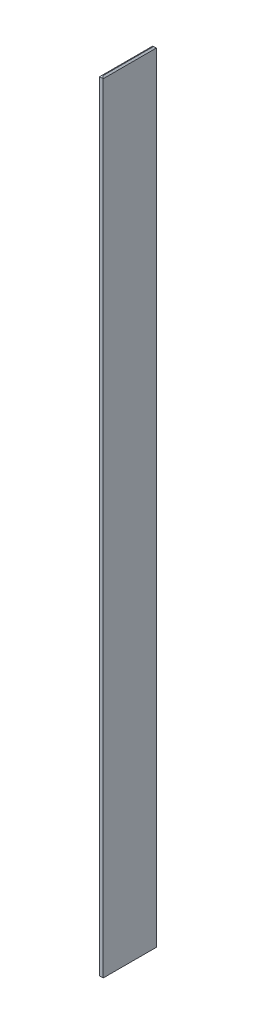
from build123d import *

# Parameters (mm, degrees)
SKETCH1_W           = 50.8
SKETCH1_H           = 762
BOSS_EXTRUDE1_DEPTH = 11217.681
CHAMFER1_SIZE       = 20


with BuildPart() as part:
    # Sketch1 → Boss-Extrude1 (new body)
    with BuildSketch(Plane(origin=(0, 0, 0), x_dir=(-1, 0, 0), z_dir=(0, 1, 0))):
        Rectangle(SKETCH1_W, SKETCH1_H)
    extrude(amount=BOSS_EXTRUDE1_DEPTH)

    # Chamfer1
    chamfer1_edges = [part.edges().sort_by_distance(p)[0] for p in [
        (25.4, 11217.681, 0),
        (0, 11217.681, -381),
        (-25.4, 11217.681, 0),
        (0, 0, -381),
        (25.4, 0, 0),
        (0, 0, 381),
        (-25.4, 0, 0),
        (0, 11217.681, 381),
    ]]
    chamfer(chamfer1_edges, length=CHAMFER1_SIZE)


solid = part.part
